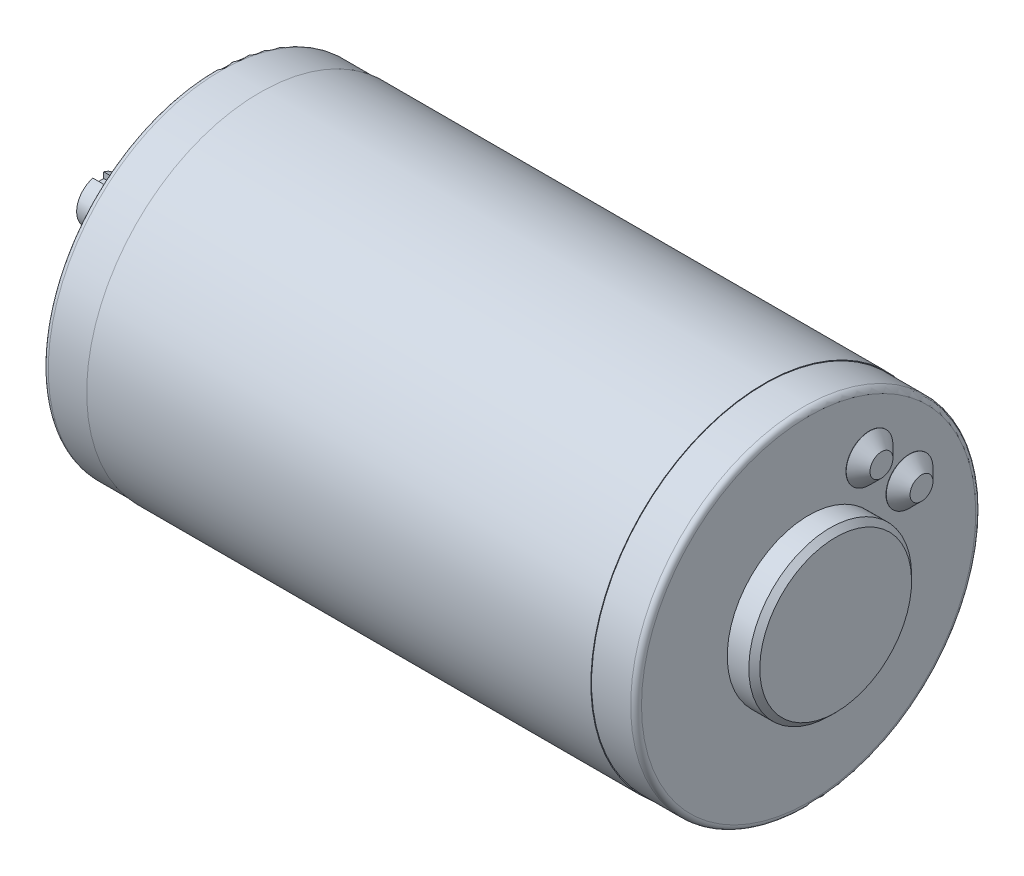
ISO-10303-21;
HEADER;
FILE_DESCRIPTION(('STEP AP214'),'2;1');
FILE_NAME('part.step','',(''),(''),'','','');
FILE_SCHEMA(('AUTOMOTIVE_DESIGN { 1 0 10303 214 1 1 1 1 }'));
ENDSEC;
DATA;
#1=APPLICATION_CONTEXT('core data for automotive mechanical design processes');
#2=APPLICATION_PROTOCOL_DEFINITION('international standard','automotive_design',2000,#1);
#3=PRODUCT_CONTEXT('',#1,'mechanical');
#4=PRODUCT('Part','Part','',(#3));
#5=PRODUCT_RELATED_PRODUCT_CATEGORY('part','',(#4));
#6=PRODUCT_DEFINITION_FORMATION('','',#4);
#7=PRODUCT_DEFINITION_CONTEXT('part definition',#1,'design');
#8=PRODUCT_DEFINITION('design','',#6,#7);
#9=PRODUCT_DEFINITION_SHAPE('','',#8);
#10=(LENGTH_UNIT() NAMED_UNIT(*) SI_UNIT(.MILLI.,.METRE.));
#11=(NAMED_UNIT(*) PLANE_ANGLE_UNIT() SI_UNIT($,.RADIAN.));
#12=(NAMED_UNIT(*) SI_UNIT($,.STERADIAN.) SOLID_ANGLE_UNIT());
#13=UNCERTAINTY_MEASURE_WITH_UNIT(LENGTH_MEASURE(1.E-05),#10,'distance_accuracy_value','');
#14=(GEOMETRIC_REPRESENTATION_CONTEXT(3) GLOBAL_UNCERTAINTY_ASSIGNED_CONTEXT((#13)) GLOBAL_UNIT_ASSIGNED_CONTEXT((#10,
#11,#12)) REPRESENTATION_CONTEXT('',''));
#15=CARTESIAN_POINT('',(0.,0.,0.));
#16=DIRECTION('',(0.,0.,1.));
#17=DIRECTION('',(1.,0.,0.));
#18=AXIS2_PLACEMENT_3D('',#15,#16,#17);
#19=CARTESIAN_POINT('',(-27.6,2.79999999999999,-1.));
#20=DIRECTION('',(0.,-1.,0.));
#21=DIRECTION('',(0.,0.,-1.));
#22=AXIS2_PLACEMENT_3D('',#19,#20,#21);
#23=PLANE('',#22);
#24=DIRECTION('',(0.,0.,-1.));
#25=VECTOR('',#24,1.);
#26=CARTESIAN_POINT('',(-21.63,2.79999999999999,-1.));
#27=LINE('',#26,#25);
#28=CARTESIAN_POINT('',(-21.63,2.79999999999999,1.));
#29=VERTEX_POINT('',#28);
#30=CARTESIAN_POINT('',(-21.63,2.79999999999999,-1.));
#31=VERTEX_POINT('',#30);
#32=EDGE_CURVE('E103',#29,#31,#27,.T.);
#33=ORIENTED_EDGE('',*,*,#32,.F.);
#34=DIRECTION('',(1.,0.,0.));
#35=VECTOR('',#34,1.);
#36=CARTESIAN_POINT('',(-27.6,2.79999999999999,1.));
#37=LINE('',#36,#35);
#38=CARTESIAN_POINT('',(-7.1,2.79999999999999,1.));
#39=VERTEX_POINT('',#38);
#40=EDGE_CURVE('E119',#29,#39,#37,.T.);
#41=ORIENTED_EDGE('',*,*,#40,.T.);
#42=CARTESIAN_POINT('',(-7.1,2.79999999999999,0.));
#43=DIRECTION('',(0.,1.,0.));
#44=DIRECTION('',(0.,0.,1.));
#45=AXIS2_PLACEMENT_3D('',#42,#43,#44);
#46=CIRCLE('',#45,1.);
#47=CARTESIAN_POINT('',(-7.1,2.79999999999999,-1.));
#48=VERTEX_POINT('',#47);
#49=EDGE_CURVE('E140',#39,#48,#46,.T.);
#50=ORIENTED_EDGE('',*,*,#49,.T.);
#51=DIRECTION('',(1.,0.,0.));
#52=VECTOR('',#51,1.);
#53=CARTESIAN_POINT('',(-27.6,2.79999999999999,-1.));
#54=LINE('',#53,#52);
#55=EDGE_CURVE('E98',#31,#48,#54,.T.);
#56=ORIENTED_EDGE('',*,*,#55,.F.);
#57=EDGE_LOOP('',(#33,#41,#50,#56));
#58=FACE_BOUND('',#57,.T.);
#59=ADVANCED_FACE('F44',(#58),#23,.F.);
#60=CARTESIAN_POINT('',(-27.6,2.79999999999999,-1.));
#61=DIRECTION('',(0.,0.,1.));
#62=DIRECTION('',(1.,0.,0.));
#63=AXIS2_PLACEMENT_3D('',#60,#61,#62);
#64=PLANE('',#63);
#65=DIRECTION('',(1.,0.,0.));
#66=VECTOR('',#65,1.);
#67=CARTESIAN_POINT('',(0.,3.87298334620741,-1.));
#68=LINE('',#67,#66);
#69=CARTESIAN_POINT('',(-21.63,3.87298334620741,-1.));
#70=VERTEX_POINT('',#69);
#71=CARTESIAN_POINT('',(-7.1,3.87298334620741,-1.));
#72=VERTEX_POINT('',#71);
#73=EDGE_CURVE('E129',#70,#72,#68,.T.);
#74=ORIENTED_EDGE('',*,*,#73,.F.);
#75=DIRECTION('',(0.,-1.,0.));
#76=VECTOR('',#75,1.);
#77=CARTESIAN_POINT('',(-21.63,2.79999999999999,-1.));
#78=LINE('',#77,#76);
#79=EDGE_CURVE('E58',#70,#31,#78,.T.);
#80=ORIENTED_EDGE('',*,*,#79,.T.);
#81=ORIENTED_EDGE('',*,*,#55,.T.);
#82=DIRECTION('',(0.,1.,0.));
#83=VECTOR('',#82,1.);
#84=CARTESIAN_POINT('',(-7.1,2.79999999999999,-1.));
#85=LINE('',#84,#83);
#86=EDGE_CURVE('E138',#48,#72,#85,.T.);
#87=ORIENTED_EDGE('',*,*,#86,.T.);
#88=EDGE_LOOP('',(#74,#80,#81,#87));
#89=FACE_BOUND('',#88,.T.);
#90=ADVANCED_FACE('F204',(#89),#64,.T.);
#91=CARTESIAN_POINT('',(-27.6,2.79999999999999,1.));
#92=DIRECTION('',(0.,0.,1.));
#93=DIRECTION('',(1.,0.,0.));
#94=AXIS2_PLACEMENT_3D('',#91,#92,#93);
#95=PLANE('',#94);
#96=DIRECTION('',(0.,-1.,0.));
#97=VECTOR('',#96,1.);
#98=CARTESIAN_POINT('',(-21.63,2.79999999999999,1.));
#99=LINE('',#98,#97);
#100=CARTESIAN_POINT('',(-21.63,3.87298334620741,1.));
#101=VERTEX_POINT('',#100);
#102=EDGE_CURVE('E106',#101,#29,#99,.T.);
#103=ORIENTED_EDGE('',*,*,#102,.F.);
#104=DIRECTION('',(1.,0.,0.));
#105=VECTOR('',#104,1.);
#106=CARTESIAN_POINT('',(0.,3.87298334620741,1.));
#107=LINE('',#106,#105);
#108=CARTESIAN_POINT('',(-7.1,3.87298334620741,1.));
#109=VERTEX_POINT('',#108);
#110=EDGE_CURVE('E117',#109,#101,#107,.F.);
#111=ORIENTED_EDGE('',*,*,#110,.F.);
#112=DIRECTION('',(0.,1.,0.));
#113=VECTOR('',#112,1.);
#114=CARTESIAN_POINT('',(-7.1,2.79999999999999,1.));
#115=LINE('',#114,#113);
#116=EDGE_CURVE('E136',#39,#109,#115,.T.);
#117=ORIENTED_EDGE('',*,*,#116,.F.);
#118=ORIENTED_EDGE('',*,*,#40,.F.);
#119=EDGE_LOOP('',(#103,#111,#117,#118));
#120=FACE_BOUND('',#119,.T.);
#121=ADVANCED_FACE('F115',(#120),#95,.F.);
#122=CARTESIAN_POINT('',(0.,0.,0.));
#123=DIRECTION('',(1.,0.,0.));
#124=DIRECTION('',(0.,0.,-1.));
#125=AXIS2_PLACEMENT_3D('',#122,#123,#124);
#126=CYLINDRICAL_SURFACE('',#125,4.);
#127=CARTESIAN_POINT('',(-4.,0.,0.));
#128=DIRECTION('',(1.,0.,0.));
#129=DIRECTION('',(0.,0.,-1.));
#130=AXIS2_PLACEMENT_3D('',#127,#128,#129);
#131=CIRCLE('',#130,4.);
#132=CARTESIAN_POINT('',(-4.,0.,-4.));
#133=VERTEX_POINT('',#132);
#134=EDGE_CURVE('E124',#133,#133,#131,.T.);
#135=ORIENTED_EDGE('',*,*,#134,.F.);
#136=EDGE_LOOP('',(#135));
#137=FACE_BOUND('',#136,.T.);
#138=ORIENTED_EDGE('',*,*,#110,.T.);
#139=CARTESIAN_POINT('',(-21.63,0.,0.));
#140=DIRECTION('',(-1.,0.,0.));
#141=DIRECTION('',(0.,0.,1.));
#142=AXIS2_PLACEMENT_3D('',#139,#140,#141);
#143=CIRCLE('',#142,4.);
#144=EDGE_CURVE('E11',#101,#70,#143,.F.);
#145=ORIENTED_EDGE('',*,*,#144,.T.);
#146=ORIENTED_EDGE('',*,*,#73,.T.);
#147=CARTESIAN_POINT('',(-7.1,3.87298334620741,-1.));
#148=CARTESIAN_POINT('',(-7.07233701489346,3.87298148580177,-1.00000033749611));
#149=CARTESIAN_POINT('',(-7.04468773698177,3.8732800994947,-0.998851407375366));
#150=CARTESIAN_POINT('',(-6.98959596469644,3.87445904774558,-0.994271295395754));
#151=CARTESIAN_POINT('',(-6.96215343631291,3.87533928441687,-0.990840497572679));
#152=CARTESIAN_POINT('',(-6.88054682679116,3.87881710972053,-0.977175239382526));
#153=CARTESIAN_POINT('',(-6.82694353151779,3.88225203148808,-0.963567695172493));
#154=CARTESIAN_POINT('',(-6.72287532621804,3.89095422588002,-0.927798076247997));
#155=CARTESIAN_POINT('',(-6.67241012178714,3.89622132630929,-0.905636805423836));
#156=CARTESIAN_POINT('',(-6.57588855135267,3.90799134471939,-0.853415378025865));
#157=CARTESIAN_POINT('',(-6.52983337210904,3.91449459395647,-0.823353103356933));
#158=CARTESIAN_POINT('',(-6.4424561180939,3.92816262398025,-0.755484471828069));
#159=CARTESIAN_POINT('',(-6.40124511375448,3.93533791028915,-0.717537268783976));
#160=CARTESIAN_POINT('',(-6.32569791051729,3.94945104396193,-0.63527578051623));
#161=CARTESIAN_POINT('',(-6.29136281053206,3.95638885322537,-0.590960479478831));
#162=CARTESIAN_POINT('',(-6.23008899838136,3.96936182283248,-0.496456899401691));
#163=CARTESIAN_POINT('',(-6.20326010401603,3.9753830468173,-0.446195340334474));
#164=CARTESIAN_POINT('',(-6.1584752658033,3.98572346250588,-0.341702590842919));
#165=CARTESIAN_POINT('',(-6.14051757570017,3.990042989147,-0.28747218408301));
#166=CARTESIAN_POINT('',(-6.11434100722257,3.99641900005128,-0.17774410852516));
#167=CARTESIAN_POINT('',(-6.10593232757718,3.998519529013,-0.122294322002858));
#168=CARTESIAN_POINT('',(-6.09849662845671,4.00037438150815,-0.0107327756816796));
#169=CARTESIAN_POINT('',(-6.09946842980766,4.00012899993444,0.0453789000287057));
#170=CARTESIAN_POINT('',(-6.11062996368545,3.99735237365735,0.155352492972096));
#171=CARTESIAN_POINT('',(-6.12061461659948,3.9948719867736,0.209236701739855));
#172=CARTESIAN_POINT('',(-6.14918867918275,3.98796330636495,0.31453871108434));
#173=CARTESIAN_POINT('',(-6.16777846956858,3.98353492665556,0.365956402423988));
#174=CARTESIAN_POINT('',(-6.21320128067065,3.97314997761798,0.465407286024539));
#175=CARTESIAN_POINT('',(-6.24010739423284,3.96717993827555,0.513405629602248));
#176=CARTESIAN_POINT('',(-6.30134312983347,3.95435945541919,0.604276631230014));
#177=CARTESIAN_POINT('',(-6.33567387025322,3.94750887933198,0.647148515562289));
#178=CARTESIAN_POINT('',(-6.41187891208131,3.93345566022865,0.72776938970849));
#179=CARTESIAN_POINT('',(-6.45393163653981,3.92624850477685,0.765349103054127));
#180=CARTESIAN_POINT('',(-6.54382986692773,3.91246168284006,0.832969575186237));
#181=CARTESIAN_POINT('',(-6.59167695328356,3.90588218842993,0.863008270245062));
#182=CARTESIAN_POINT('',(-6.69214559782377,3.89407813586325,0.914804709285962));
#183=CARTESIAN_POINT('',(-6.74479146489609,3.88886106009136,0.936517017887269));
#184=CARTESIAN_POINT('',(-6.85311692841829,3.88047058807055,0.970702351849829));
#185=CARTESIAN_POINT('',(-6.90879185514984,3.87729413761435,0.983189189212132));
#186=CARTESIAN_POINT('',(-6.9874573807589,3.87455290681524,0.993904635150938));
#187=CARTESIAN_POINT('',(-7.00991970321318,3.87396523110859,0.996190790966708));
#188=CARTESIAN_POINT('',(-7.05491778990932,3.87318062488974,0.999236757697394));
#189=CARTESIAN_POINT('',(-7.07745337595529,3.87298306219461,0.999999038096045));
#190=CARTESIAN_POINT('',(-7.1,3.87298334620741,1.));
#191=B_SPLINE_CURVE_WITH_KNOTS('',3,(#147,#148,#149,#150,#151,#152,#153,#154,#155,#156,#157,
#158,#159,#160,#161,#162,#163,#164,#165,#166,#167,#168,#169,#170,#171,#172,#173,#174,#175,#176,
#177,#178,#179,#180,#181,#182,#183,#184,#185,#186,#187,#188,#189,#190),.UNSPECIFIED.,.F.,.F.,(4,
2,2,2,2,2,2,2,2,2,2,2,2,2,2,2,2,2,2,2,2,4),(0.,0.0829365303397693,0.165859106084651,
0.331229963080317,0.496585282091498,0.661984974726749,0.830641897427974,0.999325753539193,
1.17036187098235,1.34136430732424,1.50890481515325,1.67642426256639,1.84022545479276,
2.00403389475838,2.16932509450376,2.33464120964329,2.50441429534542,2.67423379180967,
2.84496720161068,3.01544447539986,3.08315848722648,3.15076267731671),.UNSPECIFIED.);
#192=EDGE_CURVE('E123',#72,#109,#191,.T.);
#193=ORIENTED_EDGE('',*,*,#192,.T.);
#194=EDGE_LOOP('',(#138,#145,#146,#193));
#195=FACE_BOUND('',#194,.T.);
#196=ADVANCED_FACE('F121',(#137,#195),#126,.T.);
#197=CARTESIAN_POINT('',(-7.1,2.79999999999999,0.));
#198=DIRECTION('',(0.,1.,0.));
#199=DIRECTION('',(0.,0.,1.));
#200=AXIS2_PLACEMENT_3D('',#197,#198,#199);
#201=CYLINDRICAL_SURFACE('',#200,1.);
#202=ORIENTED_EDGE('',*,*,#49,.F.);
#203=ORIENTED_EDGE('',*,*,#116,.T.);
#204=ORIENTED_EDGE('',*,*,#192,.F.);
#205=ORIENTED_EDGE('',*,*,#86,.F.);
#206=EDGE_LOOP('',(#202,#203,#204,#205));
#207=FACE_BOUND('',#206,.T.);
#208=ADVANCED_FACE('F193',(#207),#201,.F.);
#209=CARTESIAN_POINT('',(-4.,4.,0.));
#210=DIRECTION('',(-1.,0.,0.));
#211=DIRECTION('',(0.,0.,1.));
#212=AXIS2_PLACEMENT_3D('',#209,#210,#211);
#213=PLANE('',#212);
#214=ORIENTED_EDGE('',*,*,#134,.T.);
#215=EDGE_LOOP('',(#214));
#216=FACE_BOUND('',#215,.T.);
#217=CARTESIAN_POINT('',(-4.,0.,0.));
#218=DIRECTION('',(1.,0.,0.));
#219=DIRECTION('',(0.,1.,0.));
#220=AXIS2_PLACEMENT_3D('',#217,#218,#219);
#221=CIRCLE('',#220,8.509);
#222=CARTESIAN_POINT('',(-4.,8.509,0.));
#223=VERTEX_POINT('',#222);
#224=EDGE_CURVE('E127',#223,#223,#221,.T.);
#225=ORIENTED_EDGE('',*,*,#224,.F.);
#226=EDGE_LOOP('',(#225));
#227=FACE_BOUND('',#226,.T.);
#228=ADVANCED_FACE('F201',(#216,#227),#213,.T.);
#229=CARTESIAN_POINT('',(111.8479,18.6070906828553,-11.2073596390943));
#230=DIRECTION('',(1.,0.,0.));
#231=DIRECTION('',(0.,0.,-1.));
#232=AXIS2_PLACEMENT_3D('',#229,#230,#231);
#233=PLANE('',#232);
#234=CARTESIAN_POINT('',(111.84789999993,18.6070906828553,-11.2073596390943));
#235=DIRECTION('',(-1.,0.,0.));
#236=DIRECTION('',(0.,-1.,0.));
#237=AXIS2_PLACEMENT_3D('',#234,#235,#236);
#238=CIRCLE('',#237,2.11800000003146);
#239=CARTESIAN_POINT('',(111.84789999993,16.4890906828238,-11.2073596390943));
#240=VERTEX_POINT('',#239);
#241=EDGE_CURVE('E183',#240,#240,#238,.T.);
#242=ORIENTED_EDGE('',*,*,#241,.F.);
#243=EDGE_LOOP('',(#242));
#244=FACE_BOUND('',#243,.T.);
#245=ADVANCED_FACE('F337',(#244),#233,.T.);
#246=CARTESIAN_POINT('',(114.6,15.0368,0.));
#247=DIRECTION('',(1.,0.,0.));
#248=DIRECTION('',(0.,0.,-1.));
#249=AXIS2_PLACEMENT_3D('',#246,#247,#248);
#250=PLANE('',#249);
#251=CARTESIAN_POINT('',(114.6,0.,0.));
#252=DIRECTION('',(-1.,0.,0.));
#253=DIRECTION('',(0.,-1.,0.));
#254=AXIS2_PLACEMENT_3D('',#251,#252,#253);
#255=CIRCLE('',#254,14.0208);
#256=CARTESIAN_POINT('',(114.6,-14.0208,0.));
#257=VERTEX_POINT('',#256);
#258=EDGE_CURVE('E180',#257,#257,#255,.T.);
#259=ORIENTED_EDGE('',*,*,#258,.F.);
#260=EDGE_LOOP('',(#259));
#261=FACE_BOUND('',#260,.T.);
#262=ADVANCED_FACE('F334',(#261),#250,.T.);
#263=CARTESIAN_POINT('',(111.8479,11.2073596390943,-18.6070906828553));
#264=DIRECTION('',(1.,0.,0.));
#265=DIRECTION('',(0.,0.,-1.));
#266=AXIS2_PLACEMENT_3D('',#263,#264,#265);
#267=PLANE('',#266);
#268=CARTESIAN_POINT('',(111.84789999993,11.2073596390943,-18.6070906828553));
#269=DIRECTION('',(-1.,0.,0.));
#270=DIRECTION('',(0.,0.,1.));
#271=AXIS2_PLACEMENT_3D('',#268,#269,#270);
#272=CIRCLE('',#271,2.1180000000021);
#273=CARTESIAN_POINT('',(111.84789999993,11.2073596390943,-16.4890906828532));
#274=VERTEX_POINT('',#273);
#275=EDGE_CURVE('E177',#274,#274,#272,.T.);
#276=ORIENTED_EDGE('',*,*,#275,.F.);
#277=EDGE_LOOP('',(#276));
#278=FACE_BOUND('',#277,.T.);
#279=ADVANCED_FACE('F330',(#278),#267,.T.);
#280=CARTESIAN_POINT('',(13.6143999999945,25.4,0.));
#281=DIRECTION('',(-1.,0.,0.));
#282=DIRECTION('',(0.,0.,1.));
#283=AXIS2_PLACEMENT_3D('',#280,#281,#282);
#284=CONICAL_SURFACE('',#283,2.01929999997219,1.02974425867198);
#285=CARTESIAN_POINT('',(14.827717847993,25.4,0.));
#286=VERTEX_POINT('',#285);
#287=VERTEX_LOOP('',#286);
#288=FACE_BOUND('',#287,.T.);
#289=CARTESIAN_POINT('',(13.6144,25.4,0.));
#290=DIRECTION('',(-1.,0.,0.));
#291=DIRECTION('',(0.,0.,1.));
#292=AXIS2_PLACEMENT_3D('',#289,#290,#291);
#293=CIRCLE('',#292,2.0193);
#294=CARTESIAN_POINT('',(13.6144,25.4,2.0193));
#295=VERTEX_POINT('',#294);
#296=EDGE_CURVE('E133',#295,#295,#293,.T.);
#297=ORIENTED_EDGE('',*,*,#296,.T.);
#298=EDGE_LOOP('',(#297));
#299=FACE_BOUND('',#298,.T.);
#300=ADVANCED_FACE('F326',(#288,#299),#284,.F.);
#301=CARTESIAN_POINT('',(13.6143999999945,-25.4,0.));
#302=DIRECTION('',(-1.,0.,0.));
#303=DIRECTION('',(0.,0.,1.));
#304=AXIS2_PLACEMENT_3D('',#301,#302,#303);
#305=CONICAL_SURFACE('',#304,2.01929999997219,1.02974425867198);
#306=CARTESIAN_POINT('',(14.827717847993,-25.4,0.));
#307=VERTEX_POINT('',#306);
#308=VERTEX_LOOP('',#307);
#309=FACE_BOUND('',#308,.T.);
#310=CARTESIAN_POINT('',(13.6144,-25.4,0.));
#311=DIRECTION('',(-1.,0.,0.));
#312=DIRECTION('',(0.,0.,1.));
#313=AXIS2_PLACEMENT_3D('',#310,#311,#312);
#314=CIRCLE('',#313,2.0193);
#315=CARTESIAN_POINT('',(13.6144,-25.4,2.0193));
#316=VERTEX_POINT('',#315);
#317=EDGE_CURVE('E359',#316,#316,#314,.T.);
#318=ORIENTED_EDGE('',*,*,#317,.T.);
#319=EDGE_LOOP('',(#318));
#320=FACE_BOUND('',#319,.T.);
#321=ADVANCED_FACE('F322',(#309,#320),#305,.F.);
#322=CARTESIAN_POINT('',(-2.984,0.,0.));
#323=DIRECTION('',(1.,0.,0.));
#324=DIRECTION('',(0.,1.,0.));
#325=AXIS2_PLACEMENT_3D('',#322,#323,#324);
#326=CONICAL_SURFACE('',#325,9.525,0.78539816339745);
#327=ORIENTED_EDGE('',*,*,#224,.T.);
#328=EDGE_LOOP('',(#327));
#329=FACE_BOUND('',#328,.T.);
#330=CARTESIAN_POINT('',(-2.984,0.,0.));
#331=DIRECTION('',(1.,0.,0.));
#332=DIRECTION('',(0.,0.,-1.));
#333=AXIS2_PLACEMENT_3D('',#330,#331,#332);
#334=CIRCLE('',#333,9.525);
#335=CARTESIAN_POINT('',(-2.984,0.,-9.525));
#336=VERTEX_POINT('',#335);
#337=EDGE_CURVE('E357',#336,#336,#334,.T.);
#338=ORIENTED_EDGE('',*,*,#337,.F.);
#339=EDGE_LOOP('',(#338));
#340=FACE_BOUND('',#339,.T.);
#341=ADVANCED_FACE('F318',(#329,#340),#326,.T.);
#342=CARTESIAN_POINT('',(109.647900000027,18.6070906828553,-11.2073596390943));
#343=DIRECTION('',(-1.,0.,0.));
#344=DIRECTION('',(0.,-1.,0.));
#345=AXIS2_PLACEMENT_3D('',#342,#343,#344);
#346=CONICAL_SURFACE('',#345,4.31799999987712,0.785398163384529);
#347=CARTESIAN_POINT('',(109.6479,18.6070906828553,-11.2073596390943));
#348=DIRECTION('',(-1.,0.,0.));
#349=DIRECTION('',(0.,0.,1.));
#350=AXIS2_PLACEMENT_3D('',#347,#348,#349);
#351=CIRCLE('',#350,4.318);
#352=CARTESIAN_POINT('',(109.6479,18.6070906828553,-6.88935963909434));
#353=VERTEX_POINT('',#352);
#354=EDGE_CURVE('E358',#353,#353,#351,.T.);
#355=ORIENTED_EDGE('',*,*,#354,.F.);
#356=EDGE_LOOP('',(#355));
#357=FACE_BOUND('',#356,.T.);
#358=ORIENTED_EDGE('',*,*,#241,.T.);
#359=EDGE_LOOP('',(#358));
#360=FACE_BOUND('',#359,.T.);
#361=ADVANCED_FACE('F314',(#357,#360),#346,.T.);
#362=CARTESIAN_POINT('',(113.584,0.,0.));
#363=DIRECTION('',(-1.,0.,0.));
#364=DIRECTION('',(0.,-1.,0.));
#365=AXIS2_PLACEMENT_3D('',#362,#363,#364);
#366=CONICAL_SURFACE('',#365,15.0368,0.785398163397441);
#367=ORIENTED_EDGE('',*,*,#258,.T.);
#368=EDGE_LOOP('',(#367));
#369=FACE_BOUND('',#368,.T.);
#370=CARTESIAN_POINT('',(113.584,0.,0.));
#371=DIRECTION('',(1.,0.,0.));
#372=DIRECTION('',(0.,0.,-1.));
#373=AXIS2_PLACEMENT_3D('',#370,#371,#372);
#374=CIRCLE('',#373,15.0368);
#375=CARTESIAN_POINT('',(113.584,0.,-15.0368));
#376=VERTEX_POINT('',#375);
#377=EDGE_CURVE('E362',#376,#376,#374,.F.);
#378=ORIENTED_EDGE('',*,*,#377,.F.);
#379=EDGE_LOOP('',(#378));
#380=FACE_BOUND('',#379,.T.);
#381=ADVANCED_FACE('F310',(#369,#380),#366,.T.);
#382=CARTESIAN_POINT('',(109.647900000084,11.2073596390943,-18.6070906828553));
#383=DIRECTION('',(-1.,0.,0.));
#384=DIRECTION('',(0.,0.,1.));
#385=AXIS2_PLACEMENT_3D('',#382,#383,#384);
#386=CONICAL_SURFACE('',#385,4.31799999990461,0.785398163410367);
#387=CARTESIAN_POINT('',(109.6479,11.2073596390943,-18.6070906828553));
#388=DIRECTION('',(-1.,0.,0.));
#389=DIRECTION('',(0.,0.,1.));
#390=AXIS2_PLACEMENT_3D('',#387,#388,#389);
#391=CIRCLE('',#390,4.318);
#392=CARTESIAN_POINT('',(109.6479,11.2073596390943,-14.2890906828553));
#393=VERTEX_POINT('',#392);
#394=EDGE_CURVE('E176',#393,#393,#391,.T.);
#395=ORIENTED_EDGE('',*,*,#394,.F.);
#396=EDGE_LOOP('',(#395));
#397=FACE_BOUND('',#396,.T.);
#398=ORIENTED_EDGE('',*,*,#275,.T.);
#399=EDGE_LOOP('',(#398));
#400=FACE_BOUND('',#399,.T.);
#401=ADVANCED_FACE('F306',(#397,#400),#386,.T.);
#402=CARTESIAN_POINT('',(0.,25.4,0.));
#403=DIRECTION('',(-1.,0.,0.));
#404=DIRECTION('',(0.,0.,1.));
#405=AXIS2_PLACEMENT_3D('',#402,#403,#404);
#406=CYLINDRICAL_SURFACE('',#405,2.0193);
#407=CARTESIAN_POINT('',(0.,25.4,0.));
#408=DIRECTION('',(-1.,0.,0.));
#409=DIRECTION('',(0.,0.,1.));
#410=AXIS2_PLACEMENT_3D('',#407,#408,#409);
#411=CIRCLE('',#410,2.0193);
#412=CARTESIAN_POINT('',(0.,25.4,2.0193));
#413=VERTEX_POINT('',#412);
#414=EDGE_CURVE('E173',#413,#413,#411,.F.);
#415=ORIENTED_EDGE('',*,*,#414,.F.);
#416=EDGE_LOOP('',(#415));
#417=FACE_BOUND('',#416,.T.);
#418=ORIENTED_EDGE('',*,*,#296,.F.);
#419=EDGE_LOOP('',(#418));
#420=FACE_BOUND('',#419,.T.);
#421=ADVANCED_FACE('F302',(#417,#420),#406,.F.);
#422=CARTESIAN_POINT('',(0.,-25.4,0.));
#423=DIRECTION('',(-1.,0.,0.));
#424=DIRECTION('',(0.,0.,1.));
#425=AXIS2_PLACEMENT_3D('',#422,#423,#424);
#426=CYLINDRICAL_SURFACE('',#425,2.0193);
#427=CARTESIAN_POINT('',(0.,-25.4,0.));
#428=DIRECTION('',(-1.,0.,0.));
#429=DIRECTION('',(0.,0.,1.));
#430=AXIS2_PLACEMENT_3D('',#427,#428,#429);
#431=CIRCLE('',#430,2.0193);
#432=CARTESIAN_POINT('',(0.,-25.4,2.0193));
#433=VERTEX_POINT('',#432);
#434=EDGE_CURVE('E170',#433,#433,#431,.F.);
#435=ORIENTED_EDGE('',*,*,#434,.F.);
#436=EDGE_LOOP('',(#435));
#437=FACE_BOUND('',#436,.T.);
#438=ORIENTED_EDGE('',*,*,#317,.F.);
#439=EDGE_LOOP('',(#438));
#440=FACE_BOUND('',#439,.T.);
#441=ADVANCED_FACE('F298',(#437,#440),#426,.F.);
#442=CARTESIAN_POINT('',(0.,0.,0.));
#443=DIRECTION('',(1.,0.,0.));
#444=DIRECTION('',(0.,0.,-1.));
#445=AXIS2_PLACEMENT_3D('',#442,#443,#444);
#446=CYLINDRICAL_SURFACE('',#445,9.525);
#447=ORIENTED_EDGE('',*,*,#337,.T.);
#448=EDGE_LOOP('',(#447));
#449=FACE_BOUND('',#448,.T.);
#450=CARTESIAN_POINT('',(0.,0.,0.));
#451=DIRECTION('',(1.,0.,0.));
#452=DIRECTION('',(0.,0.,-1.));
#453=AXIS2_PLACEMENT_3D('',#450,#451,#452);
#454=CIRCLE('',#453,9.525);
#455=CARTESIAN_POINT('',(0.,0.,-9.525));
#456=VERTEX_POINT('',#455);
#457=EDGE_CURVE('E167',#456,#456,#454,.T.);
#458=ORIENTED_EDGE('',*,*,#457,.F.);
#459=EDGE_LOOP('',(#458));
#460=FACE_BOUND('',#459,.T.);
#461=ADVANCED_FACE('F294',(#449,#460),#446,.T.);
#462=CARTESIAN_POINT('',(111.8479,18.6070906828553,-11.2073596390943));
#463=DIRECTION('',(-1.,0.,0.));
#464=DIRECTION('',(0.,0.,1.));
#465=AXIS2_PLACEMENT_3D('',#462,#463,#464);
#466=CYLINDRICAL_SURFACE('',#465,4.318);
#467=CARTESIAN_POINT('',(109.6,18.6070906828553,-11.2073596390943));
#468=DIRECTION('',(-1.,0.,0.));
#469=DIRECTION('',(0.,0.,1.));
#470=AXIS2_PLACEMENT_3D('',#467,#468,#469);
#471=CIRCLE('',#470,4.318);
#472=CARTESIAN_POINT('',(109.6,18.6070906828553,-6.88935963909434));
#473=VERTEX_POINT('',#472);
#474=EDGE_CURVE('E164',#473,#473,#471,.T.);
#475=ORIENTED_EDGE('',*,*,#474,.F.);
#476=EDGE_LOOP('',(#475));
#477=FACE_BOUND('',#476,.T.);
#478=ORIENTED_EDGE('',*,*,#354,.T.);
#479=EDGE_LOOP('',(#478));
#480=FACE_BOUND('',#479,.T.);
#481=ADVANCED_FACE('F290',(#477,#480),#466,.T.);
#482=CARTESIAN_POINT('',(0.,0.,0.));
#483=DIRECTION('',(1.,0.,0.));
#484=DIRECTION('',(0.,0.,-1.));
#485=AXIS2_PLACEMENT_3D('',#482,#483,#484);
#486=CYLINDRICAL_SURFACE('',#485,15.0368);
#487=CARTESIAN_POINT('',(109.6,0.,0.));
#488=DIRECTION('',(1.,0.,0.));
#489=DIRECTION('',(0.,0.,-1.));
#490=AXIS2_PLACEMENT_3D('',#487,#488,#489);
#491=CIRCLE('',#490,15.0368);
#492=CARTESIAN_POINT('',(109.6,0.,-15.0368));
#493=VERTEX_POINT('',#492);
#494=EDGE_CURVE('E161',#493,#493,#491,.F.);
#495=ORIENTED_EDGE('',*,*,#494,.F.);
#496=EDGE_LOOP('',(#495));
#497=FACE_BOUND('',#496,.T.);
#498=ORIENTED_EDGE('',*,*,#377,.T.);
#499=EDGE_LOOP('',(#498));
#500=FACE_BOUND('',#499,.T.);
#501=ADVANCED_FACE('F286',(#497,#500),#486,.T.);
#502=CARTESIAN_POINT('',(111.8479,11.2073596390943,-18.6070906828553));
#503=DIRECTION('',(-1.,0.,0.));
#504=DIRECTION('',(0.,0.,1.));
#505=AXIS2_PLACEMENT_3D('',#502,#503,#504);
#506=CYLINDRICAL_SURFACE('',#505,4.318);
#507=CARTESIAN_POINT('',(109.6,11.2073596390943,-18.6070906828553));
#508=DIRECTION('',(-1.,0.,0.));
#509=DIRECTION('',(0.,0.,1.));
#510=AXIS2_PLACEMENT_3D('',#507,#508,#509);
#511=CIRCLE('',#510,4.318);
#512=CARTESIAN_POINT('',(109.6,11.2073596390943,-14.2890906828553));
#513=VERTEX_POINT('',#512);
#514=EDGE_CURVE('E157',#513,#513,#511,.T.);
#515=ORIENTED_EDGE('',*,*,#514,.F.);
#516=EDGE_LOOP('',(#515));
#517=FACE_BOUND('',#516,.T.);
#518=ORIENTED_EDGE('',*,*,#394,.T.);
#519=EDGE_LOOP('',(#518));
#520=FACE_BOUND('',#519,.T.);
#521=ADVANCED_FACE('F280',(#517,#520),#506,.T.);
#522=CARTESIAN_POINT('',(0.,9.525,0.));
#523=DIRECTION('',(-1.,0.,0.));
#524=DIRECTION('',(0.,0.,1.));
#525=AXIS2_PLACEMENT_3D('',#522,#523,#524);
#526=PLANE('',#525);
#527=ORIENTED_EDGE('',*,*,#457,.T.);
#528=EDGE_LOOP('',(#527));
#529=FACE_BOUND('',#528,.T.);
#530=CARTESIAN_POINT('',(0.,0.,0.));
#531=DIRECTION('',(1.,0.,0.));
#532=DIRECTION('',(0.,0.,-1.));
#533=AXIS2_PLACEMENT_3D('',#530,#531,#532);
#534=CIRCLE('',#533,30.877);
#535=CARTESIAN_POINT('',(0.,0.,-30.877));
#536=VERTEX_POINT('',#535);
#537=CARTESIAN_POINT('',(0.,0.,30.877));
#538=VERTEX_POINT('',#537);
#539=EDGE_CURVE('E160',#536,#538,#534,.T.);
#540=ORIENTED_EDGE('',*,*,#539,.F.);
#541=CARTESIAN_POINT('',(0.,0.,0.));
#542=DIRECTION('',(1.,0.,0.));
#543=DIRECTION('',(0.,0.,1.));
#544=AXIS2_PLACEMENT_3D('',#541,#542,#543);
#545=CIRCLE('',#544,30.877);
#546=EDGE_CURVE('E257',#538,#536,#545,.T.);
#547=ORIENTED_EDGE('',*,*,#546,.F.);
#548=EDGE_LOOP('',(#540,#547));
#549=FACE_BOUND('',#548,.T.);
#550=ORIENTED_EDGE('',*,*,#434,.T.);
#551=EDGE_LOOP('',(#550));
#552=FACE_BOUND('',#551,.T.);
#553=ORIENTED_EDGE('',*,*,#414,.T.);
#554=EDGE_LOOP('',(#553));
#555=FACE_BOUND('',#554,.T.);
#556=ADVANCED_FACE('F261',(#529,#549,#552,#555),#526,.T.);
#557=CARTESIAN_POINT('',(109.6,31.877,0.));
#558=DIRECTION('',(1.,0.,0.));
#559=DIRECTION('',(0.,0.,-1.));
#560=AXIS2_PLACEMENT_3D('',#557,#558,#559);
#561=PLANE('',#560);
#562=ORIENTED_EDGE('',*,*,#514,.T.);
#563=EDGE_LOOP('',(#562));
#564=FACE_BOUND('',#563,.T.);
#565=ORIENTED_EDGE('',*,*,#494,.T.);
#566=EDGE_LOOP('',(#565));
#567=FACE_BOUND('',#566,.T.);
#568=CARTESIAN_POINT('',(109.6,0.,0.));
#569=DIRECTION('',(-1.,0.,0.));
#570=DIRECTION('',(0.,0.,1.));
#571=AXIS2_PLACEMENT_3D('',#568,#569,#570);
#572=CIRCLE('',#571,30.877);
#573=CARTESIAN_POINT('',(109.6,0.,30.877));
#574=VERTEX_POINT('',#573);
#575=CARTESIAN_POINT('',(109.6,0.,-30.877));
#576=VERTEX_POINT('',#575);
#577=EDGE_CURVE('E65',#574,#576,#572,.T.);
#578=ORIENTED_EDGE('',*,*,#577,.F.);
#579=CARTESIAN_POINT('',(109.6,0.,0.));
#580=DIRECTION('',(-1.,0.,0.));
#581=DIRECTION('',(0.,0.,-1.));
#582=AXIS2_PLACEMENT_3D('',#579,#580,#581);
#583=CIRCLE('',#582,30.877);
#584=EDGE_CURVE('E424',#576,#574,#583,.T.);
#585=ORIENTED_EDGE('',*,*,#584,.F.);
#586=EDGE_LOOP('',(#578,#585));
#587=FACE_BOUND('',#586,.T.);
#588=ORIENTED_EDGE('',*,*,#474,.T.);
#589=EDGE_LOOP('',(#588));
#590=FACE_BOUND('',#589,.T.);
#591=ADVANCED_FACE('F279',(#564,#567,#587,#590),#561,.T.);
#592=CARTESIAN_POINT('',(0.999999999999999,0.,0.));
#593=DIRECTION('',(-1.,0.,0.));
#594=DIRECTION('',(0.,0.,1.));
#595=AXIS2_PLACEMENT_3D('',#592,#593,#594);
#596=TOROIDAL_SURFACE('',#595,30.877,1.);
#597=CARTESIAN_POINT('',(0.999999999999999,0.,0.));
#598=DIRECTION('',(1.,0.,0.));
#599=DIRECTION('',(0.,0.,-1.));
#600=AXIS2_PLACEMENT_3D('',#597,#598,#599);
#601=CIRCLE('',#600,31.877);
#602=CARTESIAN_POINT('',(0.999999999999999,0.,-31.877));
#603=VERTEX_POINT('',#602);
#604=EDGE_CURVE('E422',#603,#603,#601,.T.);
#605=ORIENTED_EDGE('',*,*,#604,.F.);
#606=EDGE_LOOP('',(#605));
#607=FACE_BOUND('',#606,.T.);
#608=ORIENTED_EDGE('',*,*,#546,.T.);
#609=ORIENTED_EDGE('',*,*,#539,.T.);
#610=EDGE_LOOP('',(#608,#609));
#611=FACE_BOUND('',#610,.T.);
#612=ADVANCED_FACE('F226',(#607,#611),#596,.T.);
#613=CARTESIAN_POINT('',(108.6,0.,0.));
#614=DIRECTION('',(1.,0.,0.));
#615=DIRECTION('',(0.,0.,-1.));
#616=AXIS2_PLACEMENT_3D('',#613,#614,#615);
#617=TOROIDAL_SURFACE('',#616,30.877,1.);
#618=CARTESIAN_POINT('',(108.6,0.,0.));
#619=DIRECTION('',(1.,0.,0.));
#620=DIRECTION('',(0.,0.,-1.));
#621=AXIS2_PLACEMENT_3D('',#618,#619,#620);
#622=CIRCLE('',#621,31.877);
#623=CARTESIAN_POINT('',(108.6,0.,-31.877));
#624=VERTEX_POINT('',#623);
#625=EDGE_CURVE('E156',#624,#624,#622,.F.);
#626=ORIENTED_EDGE('',*,*,#625,.F.);
#627=EDGE_LOOP('',(#626));
#628=FACE_BOUND('',#627,.T.);
#629=ORIENTED_EDGE('',*,*,#584,.T.);
#630=ORIENTED_EDGE('',*,*,#577,.T.);
#631=EDGE_LOOP('',(#629,#630));
#632=FACE_BOUND('',#631,.T.);
#633=ADVANCED_FACE('F220',(#628,#632),#617,.T.);
#634=CARTESIAN_POINT('',(0.,0.,0.));
#635=DIRECTION('',(1.,0.,0.));
#636=DIRECTION('',(0.,0.,-1.));
#637=AXIS2_PLACEMENT_3D('',#634,#635,#636);
#638=CYLINDRICAL_SURFACE('',#637,31.877);
#639=ORIENTED_EDGE('',*,*,#604,.T.);
#640=EDGE_LOOP('',(#639));
#641=FACE_BOUND('',#640,.T.);
#642=CARTESIAN_POINT('',(8.2296,0.,0.));
#643=DIRECTION('',(1.,0.,0.));
#644=DIRECTION('',(0.,0.,-1.));
#645=AXIS2_PLACEMENT_3D('',#642,#643,#644);
#646=CIRCLE('',#645,31.877);
#647=CARTESIAN_POINT('',(8.2296,0.,-31.877));
#648=VERTEX_POINT('',#647);
#649=EDGE_CURVE('E152',#648,#648,#646,.T.);
#650=ORIENTED_EDGE('',*,*,#649,.F.);
#651=EDGE_LOOP('',(#650));
#652=FACE_BOUND('',#651,.T.);
#653=ADVANCED_FACE('F225',(#641,#652),#638,.T.);
#654=CARTESIAN_POINT('',(0.,0.,0.));
#655=DIRECTION('',(1.,0.,0.));
#656=DIRECTION('',(0.,0.,-1.));
#657=AXIS2_PLACEMENT_3D('',#654,#655,#656);
#658=CYLINDRICAL_SURFACE('',#657,31.877);
#659=CARTESIAN_POINT('',(101.3704,0.,0.));
#660=DIRECTION('',(1.,0.,0.));
#661=DIRECTION('',(0.,0.,-1.));
#662=AXIS2_PLACEMENT_3D('',#659,#660,#661);
#663=CIRCLE('',#662,31.877);
#664=CARTESIAN_POINT('',(101.3704,0.,-31.877));
#665=VERTEX_POINT('',#664);
#666=EDGE_CURVE('E149',#665,#665,#663,.F.);
#667=ORIENTED_EDGE('',*,*,#666,.F.);
#668=EDGE_LOOP('',(#667));
#669=FACE_BOUND('',#668,.T.);
#670=ORIENTED_EDGE('',*,*,#625,.T.);
#671=EDGE_LOOP('',(#670));
#672=FACE_BOUND('',#671,.T.);
#673=ADVANCED_FACE('F410',(#669,#672),#658,.T.);
#674=CARTESIAN_POINT('',(8.2296,31.877,0.));
#675=DIRECTION('',(-1.,0.,0.));
#676=DIRECTION('',(0.,0.,1.));
#677=AXIS2_PLACEMENT_3D('',#674,#675,#676);
#678=PLANE('',#677);
#679=CARTESIAN_POINT('',(8.2296,0.,0.));
#680=DIRECTION('',(1.,0.,0.));
#681=DIRECTION('',(0.,0.,-1.));
#682=AXIS2_PLACEMENT_3D('',#679,#680,#681);
#683=CIRCLE('',#682,32.004);
#684=CARTESIAN_POINT('',(8.2296,0.,-32.004));
#685=VERTEX_POINT('',#684);
#686=EDGE_CURVE('E145',#685,#685,#683,.T.);
#687=ORIENTED_EDGE('',*,*,#686,.F.);
#688=EDGE_LOOP('',(#687));
#689=FACE_BOUND('',#688,.T.);
#690=ORIENTED_EDGE('',*,*,#649,.T.);
#691=EDGE_LOOP('',(#690));
#692=FACE_BOUND('',#691,.T.);
#693=ADVANCED_FACE('F407',(#689,#692),#678,.T.);
#694=CARTESIAN_POINT('',(101.3704,32.004,0.));
#695=DIRECTION('',(1.,0.,0.));
#696=DIRECTION('',(0.,0.,-1.));
#697=AXIS2_PLACEMENT_3D('',#694,#695,#696);
#698=PLANE('',#697);
#699=ORIENTED_EDGE('',*,*,#666,.T.);
#700=EDGE_LOOP('',(#699));
#701=FACE_BOUND('',#700,.T.);
#702=CARTESIAN_POINT('',(101.3704,0.,0.));
#703=DIRECTION('',(1.,0.,0.));
#704=DIRECTION('',(0.,0.,-1.));
#705=AXIS2_PLACEMENT_3D('',#702,#703,#704);
#706=CIRCLE('',#705,32.004);
#707=CARTESIAN_POINT('',(101.3704,0.,-32.004));
#708=VERTEX_POINT('',#707);
#709=EDGE_CURVE('E51',#708,#708,#706,.F.);
#710=ORIENTED_EDGE('',*,*,#709,.F.);
#711=EDGE_LOOP('',(#710));
#712=FACE_BOUND('',#711,.T.);
#713=ADVANCED_FACE('F401',(#701,#712),#698,.T.);
#714=CARTESIAN_POINT('',(0.,0.,0.));
#715=DIRECTION('',(1.,0.,0.));
#716=DIRECTION('',(0.,0.,-1.));
#717=AXIS2_PLACEMENT_3D('',#714,#715,#716);
#718=CYLINDRICAL_SURFACE('',#717,32.004);
#719=ORIENTED_EDGE('',*,*,#709,.T.);
#720=EDGE_LOOP('',(#719));
#721=FACE_BOUND('',#720,.T.);
#722=ORIENTED_EDGE('',*,*,#686,.T.);
#723=EDGE_LOOP('',(#722));
#724=FACE_BOUND('',#723,.T.);
#725=ADVANCED_FACE('F200',(#721,#724),#718,.T.);
#726=CARTESIAN_POINT('',(-21.63,0.,0.));
#727=DIRECTION('',(-1.,0.,0.));
#728=DIRECTION('',(0.,0.,1.));
#729=AXIS2_PLACEMENT_3D('',#726,#727,#728);
#730=PLANE('',#729);
#731=ORIENTED_EDGE('',*,*,#32,.T.);
#732=ORIENTED_EDGE('',*,*,#79,.F.);
#733=ORIENTED_EDGE('',*,*,#144,.F.);
#734=ORIENTED_EDGE('',*,*,#102,.T.);
#735=EDGE_LOOP('',(#731,#732,#733,#734));
#736=FACE_BOUND('',#735,.T.);
#737=ADVANCED_FACE('F108',(#736),#730,.T.);
#738=CLOSED_SHELL('',(#59,#90,#121,#196,#208,#228,#245,#262,#279,#300,#321,#341,#361,#381,#401,
#421,#441,#461,#481,#501,#521,#556,#591,#612,#633,#653,#673,#693,#713,#725,#737));
#739=MANIFOLD_SOLID_BREP('B2',#738);
#740=ADVANCED_BREP_SHAPE_REPRESENTATION('',(#18,#739),#14);
#741=SHAPE_DEFINITION_REPRESENTATION(#9,#740);
ENDSEC;
END-ISO-10303-21;
